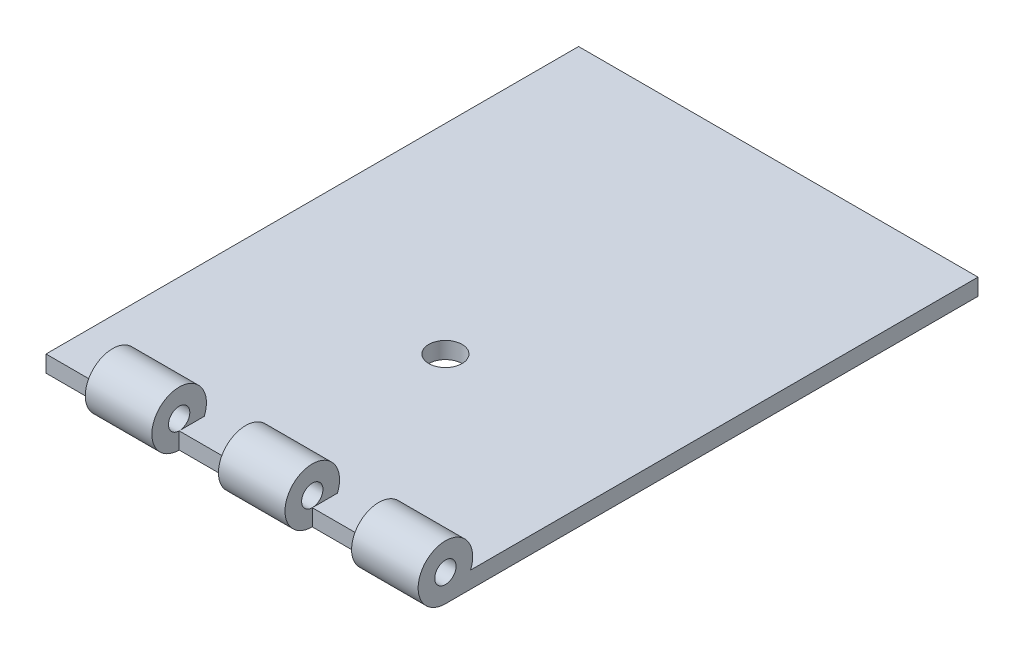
ISO-10303-21;
HEADER;
FILE_DESCRIPTION(('STEP AP214'),'2;1');
FILE_NAME('part.step','',(''),(''),'','','');
FILE_SCHEMA(('AUTOMOTIVE_DESIGN { 1 0 10303 214 1 1 1 1 }'));
ENDSEC;
DATA;
#1=APPLICATION_CONTEXT('core data for automotive mechanical design processes');
#2=APPLICATION_PROTOCOL_DEFINITION('international standard','automotive_design',2000,#1);
#3=PRODUCT_CONTEXT('',#1,'mechanical');
#4=PRODUCT('Part','Part','',(#3));
#5=PRODUCT_RELATED_PRODUCT_CATEGORY('part','',(#4));
#6=PRODUCT_DEFINITION_FORMATION('','',#4);
#7=PRODUCT_DEFINITION_CONTEXT('part definition',#1,'design');
#8=PRODUCT_DEFINITION('design','',#6,#7);
#9=PRODUCT_DEFINITION_SHAPE('','',#8);
#10=(LENGTH_UNIT() NAMED_UNIT(*) SI_UNIT(.MILLI.,.METRE.));
#11=(NAMED_UNIT(*) PLANE_ANGLE_UNIT() SI_UNIT($,.RADIAN.));
#12=(NAMED_UNIT(*) SI_UNIT($,.STERADIAN.) SOLID_ANGLE_UNIT());
#13=UNCERTAINTY_MEASURE_WITH_UNIT(LENGTH_MEASURE(1.E-05),#10,'distance_accuracy_value','');
#14=(GEOMETRIC_REPRESENTATION_CONTEXT(3) GLOBAL_UNCERTAINTY_ASSIGNED_CONTEXT((#13)) GLOBAL_UNIT_ASSIGNED_CONTEXT((#10,
#11,#12)) REPRESENTATION_CONTEXT('',''));
#15=CARTESIAN_POINT('',(0.,0.,0.));
#16=DIRECTION('',(0.,0.,1.));
#17=DIRECTION('',(1.,0.,0.));
#18=AXIS2_PLACEMENT_3D('',#15,#16,#17);
#19=CARTESIAN_POINT('',(-19.05,1.5875,38.1));
#20=DIRECTION('',(0.,0.,-1.));
#21=DIRECTION('',(-1.,0.,0.));
#22=AXIS2_PLACEMENT_3D('',#19,#20,#21);
#23=PLANE('',#22);
#24=DIRECTION('',(0.,-1.,0.));
#25=VECTOR('',#24,1.);
#26=CARTESIAN_POINT('',(-12.7,1.5875,38.1));
#27=LINE('',#26,#25);
#28=CARTESIAN_POINT('',(-12.7,1.5875,38.1));
#29=VERTEX_POINT('',#28);
#30=CARTESIAN_POINT('',(-12.7,0.,38.1));
#31=VERTEX_POINT('',#30);
#32=EDGE_CURVE('E161',#29,#31,#27,.T.);
#33=ORIENTED_EDGE('',*,*,#32,.F.);
#34=DIRECTION('',(1.,0.,0.));
#35=VECTOR('',#34,1.);
#36=CARTESIAN_POINT('',(-19.05,1.5875,38.1));
#37=LINE('',#36,#35);
#38=CARTESIAN_POINT('',(-19.05,1.5875,38.1));
#39=VERTEX_POINT('',#38);
#40=EDGE_CURVE('E217',#39,#29,#37,.T.);
#41=ORIENTED_EDGE('',*,*,#40,.F.);
#42=DIRECTION('',(0.,-1.,0.));
#43=VECTOR('',#42,1.);
#44=CARTESIAN_POINT('',(-19.05,1.5875,38.1));
#45=LINE('',#44,#43);
#46=CARTESIAN_POINT('',(-19.05,0.,38.1));
#47=VERTEX_POINT('',#46);
#48=EDGE_CURVE('E219',#39,#47,#45,.T.);
#49=ORIENTED_EDGE('',*,*,#48,.T.);
#50=DIRECTION('',(1.,0.,0.));
#51=VECTOR('',#50,1.);
#52=CARTESIAN_POINT('',(-19.05,0.,38.1));
#53=LINE('',#52,#51);
#54=EDGE_CURVE('E130',#47,#31,#53,.T.);
#55=ORIENTED_EDGE('',*,*,#54,.T.);
#56=EDGE_LOOP('',(#33,#41,#49,#55));
#57=FACE_BOUND('',#56,.T.);
#58=ADVANCED_FACE('F33',(#57),#23,.F.);
#59=CARTESIAN_POINT('',(0.,1.5875,0.));
#60=DIRECTION('',(0.,-1.,0.));
#61=DIRECTION('',(0.,0.,-1.));
#62=AXIS2_PLACEMENT_3D('',#59,#60,#61);
#63=PLANE('',#62);
#64=CARTESIAN_POINT('',(0.,1.5875,19.05));
#65=DIRECTION('',(0.,-1.,0.));
#66=DIRECTION('',(0.,0.,-1.));
#67=AXIS2_PLACEMENT_3D('',#64,#65,#66);
#68=CIRCLE('',#67,1.5875);
#69=CARTESIAN_POINT('',(0.,1.5875,20.6375));
#70=VERTEX_POINT('',#69);
#71=EDGE_CURVE('E451',#70,#70,#68,.T.);
#72=ORIENTED_EDGE('',*,*,#71,.T.);
#73=EDGE_LOOP('',(#72));
#74=FACE_BOUND('',#73,.T.);
#75=DIRECTION('',(0.,0.,1.));
#76=VECTOR('',#75,1.);
#77=CARTESIAN_POINT('',(-12.7,1.5875,0.));
#78=LINE('',#77,#76);
#79=CARTESIAN_POINT('',(-12.7,1.5875,35.7029275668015));
#80=VERTEX_POINT('',#79);
#81=EDGE_CURVE('E48',#80,#29,#78,.T.);
#82=ORIENTED_EDGE('',*,*,#81,.F.);
#83=DIRECTION('',(1.,0.,0.));
#84=VECTOR('',#83,1.);
#85=CARTESIAN_POINT('',(-12.7,1.5875,35.7029275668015));
#86=LINE('',#85,#84);
#87=CARTESIAN_POINT('',(-6.35,1.5875,35.7029275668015));
#88=VERTEX_POINT('',#87);
#89=EDGE_CURVE('E52',#80,#88,#86,.T.);
#90=ORIENTED_EDGE('',*,*,#89,.T.);
#91=DIRECTION('',(0.,0.,1.));
#92=VECTOR('',#91,1.);
#93=CARTESIAN_POINT('',(-6.35,1.5875,0.));
#94=LINE('',#93,#92);
#95=CARTESIAN_POINT('',(-6.35,1.5875,38.1));
#96=VERTEX_POINT('',#95);
#97=EDGE_CURVE('E140',#88,#96,#94,.T.);
#98=ORIENTED_EDGE('',*,*,#97,.T.);
#99=CARTESIAN_POINT('',(0.,1.5875,38.1));
#100=VERTEX_POINT('',#99);
#101=EDGE_CURVE('E135',#96,#100,#37,.T.);
#102=ORIENTED_EDGE('',*,*,#101,.T.);
#103=DIRECTION('',(0.,0.,1.));
#104=VECTOR('',#103,1.);
#105=CARTESIAN_POINT('',(0.,1.5875,0.));
#106=LINE('',#105,#104);
#107=CARTESIAN_POINT('',(0.,1.5875,35.7029275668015));
#108=VERTEX_POINT('',#107);
#109=EDGE_CURVE('E182',#108,#100,#106,.T.);
#110=ORIENTED_EDGE('',*,*,#109,.F.);
#111=DIRECTION('',(1.,0.,0.));
#112=VECTOR('',#111,1.);
#113=CARTESIAN_POINT('',(0.,1.5875,35.7029275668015));
#114=LINE('',#113,#112);
#115=CARTESIAN_POINT('',(6.35,1.5875,35.7029275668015));
#116=VERTEX_POINT('',#115);
#117=EDGE_CURVE('E187',#108,#116,#114,.T.);
#118=ORIENTED_EDGE('',*,*,#117,.T.);
#119=DIRECTION('',(0.,0.,1.));
#120=VECTOR('',#119,1.);
#121=CARTESIAN_POINT('',(6.35,1.5875,0.));
#122=LINE('',#121,#120);
#123=CARTESIAN_POINT('',(6.35,1.5875,38.1));
#124=VERTEX_POINT('',#123);
#125=EDGE_CURVE('E175',#116,#124,#122,.T.);
#126=ORIENTED_EDGE('',*,*,#125,.T.);
#127=CARTESIAN_POINT('',(12.7,1.5875,38.1));
#128=VERTEX_POINT('',#127);
#129=EDGE_CURVE('E216',#124,#128,#37,.T.);
#130=ORIENTED_EDGE('',*,*,#129,.T.);
#131=DIRECTION('',(0.,0.,1.));
#132=VECTOR('',#131,1.);
#133=CARTESIAN_POINT('',(12.7,1.5875,0.));
#134=LINE('',#133,#132);
#135=CARTESIAN_POINT('',(12.7,1.5875,35.7029275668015));
#136=VERTEX_POINT('',#135);
#137=EDGE_CURVE('E199',#136,#128,#134,.T.);
#138=ORIENTED_EDGE('',*,*,#137,.F.);
#139=DIRECTION('',(1.,0.,0.));
#140=VECTOR('',#139,1.);
#141=CARTESIAN_POINT('',(12.7,1.5875,35.7029275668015));
#142=LINE('',#141,#140);
#143=CARTESIAN_POINT('',(19.05,1.5875,35.7029275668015));
#144=VERTEX_POINT('',#143);
#145=EDGE_CURVE('E207',#136,#144,#142,.T.);
#146=ORIENTED_EDGE('',*,*,#145,.T.);
#147=DIRECTION('',(0.,0.,-1.));
#148=VECTOR('',#147,1.);
#149=CARTESIAN_POINT('',(19.05,1.5875,38.1));
#150=LINE('',#149,#148);
#151=CARTESIAN_POINT('',(19.05,1.5875,-12.7));
#152=VERTEX_POINT('',#151);
#153=EDGE_CURVE('E210',#144,#152,#150,.T.);
#154=ORIENTED_EDGE('',*,*,#153,.T.);
#155=DIRECTION('',(-1.,0.,0.));
#156=VECTOR('',#155,1.);
#157=CARTESIAN_POINT('',(-19.05,1.5875,-12.7));
#158=LINE('',#157,#156);
#159=CARTESIAN_POINT('',(-19.05,1.5875,-12.7));
#160=VERTEX_POINT('',#159);
#161=EDGE_CURVE('E212',#152,#160,#158,.T.);
#162=ORIENTED_EDGE('',*,*,#161,.T.);
#163=DIRECTION('',(0.,0.,1.));
#164=VECTOR('',#163,1.);
#165=CARTESIAN_POINT('',(-19.05,1.5875,38.1));
#166=LINE('',#165,#164);
#167=EDGE_CURVE('E214',#160,#39,#166,.T.);
#168=ORIENTED_EDGE('',*,*,#167,.T.);
#169=ORIENTED_EDGE('',*,*,#40,.T.);
#170=EDGE_LOOP('',(#82,#90,#98,#102,#110,#118,#126,#130,#138,#146,#154,#162,#168,#169));
#171=FACE_BOUND('',#170,.T.);
#172=ADVANCED_FACE('F257',(#74,#171),#63,.F.);
#173=ORIENTED_EDGE('',*,*,#101,.F.);
#174=DIRECTION('',(0.,-1.,0.));
#175=VECTOR('',#174,1.);
#176=CARTESIAN_POINT('',(-6.35,1.5875,38.1));
#177=LINE('',#176,#175);
#178=CARTESIAN_POINT('',(-6.35,0.,38.1));
#179=VERTEX_POINT('',#178);
#180=EDGE_CURVE('E133',#96,#179,#177,.T.);
#181=ORIENTED_EDGE('',*,*,#180,.T.);
#182=CARTESIAN_POINT('',(0.,0.,38.1));
#183=VERTEX_POINT('',#182);
#184=EDGE_CURVE('E117',#179,#183,#53,.T.);
#185=ORIENTED_EDGE('',*,*,#184,.T.);
#186=DIRECTION('',(0.,-1.,0.));
#187=VECTOR('',#186,1.);
#188=CARTESIAN_POINT('',(0.,1.5875,38.1));
#189=LINE('',#188,#187);
#190=EDGE_CURVE('E185',#100,#183,#189,.T.);
#191=ORIENTED_EDGE('',*,*,#190,.F.);
#192=EDGE_LOOP('',(#173,#181,#185,#191));
#193=FACE_BOUND('',#192,.T.);
#194=ADVANCED_FACE('F134',(#193),#23,.F.);
#195=ORIENTED_EDGE('',*,*,#129,.F.);
#196=DIRECTION('',(0.,-1.,0.));
#197=VECTOR('',#196,1.);
#198=CARTESIAN_POINT('',(6.35,1.5875,38.1));
#199=LINE('',#198,#197);
#200=CARTESIAN_POINT('',(6.35,0.,38.1));
#201=VERTEX_POINT('',#200);
#202=EDGE_CURVE('E179',#124,#201,#199,.T.);
#203=ORIENTED_EDGE('',*,*,#202,.T.);
#204=CARTESIAN_POINT('',(12.7,0.,38.1));
#205=VERTEX_POINT('',#204);
#206=EDGE_CURVE('E149',#201,#205,#53,.T.);
#207=ORIENTED_EDGE('',*,*,#206,.T.);
#208=DIRECTION('',(0.,-1.,0.));
#209=VECTOR('',#208,1.);
#210=CARTESIAN_POINT('',(12.7,1.5875,38.1));
#211=LINE('',#210,#209);
#212=EDGE_CURVE('E204',#128,#205,#211,.T.);
#213=ORIENTED_EDGE('',*,*,#212,.F.);
#214=EDGE_LOOP('',(#195,#203,#207,#213));
#215=FACE_BOUND('',#214,.T.);
#216=ADVANCED_FACE('F259',(#215),#23,.F.);
#217=CARTESIAN_POINT('',(19.05,1.5875,38.1));
#218=DIRECTION('',(-1.,0.,0.));
#219=DIRECTION('',(0.,0.,1.));
#220=AXIS2_PLACEMENT_3D('',#217,#218,#219);
#221=PLANE('',#220);
#222=ORIENTED_EDGE('',*,*,#153,.F.);
#223=CARTESIAN_POINT('',(19.05,2.6035,38.1));
#224=DIRECTION('',(1.,0.,0.));
#225=DIRECTION('',(0.,0.,-1.));
#226=AXIS2_PLACEMENT_3D('',#223,#224,#225);
#227=CIRCLE('',#226,2.6035);
#228=CARTESIAN_POINT('',(19.05,0.,38.1));
#229=VERTEX_POINT('',#228);
#230=EDGE_CURVE('E193',#144,#229,#227,.T.);
#231=ORIENTED_EDGE('',*,*,#230,.T.);
#232=DIRECTION('',(0.,0.,-1.));
#233=VECTOR('',#232,1.);
#234=CARTESIAN_POINT('',(19.05,0.,38.1));
#235=LINE('',#234,#233);
#236=CARTESIAN_POINT('',(19.05,0.,-12.7));
#237=VERTEX_POINT('',#236);
#238=EDGE_CURVE('E209',#229,#237,#235,.T.);
#239=ORIENTED_EDGE('',*,*,#238,.T.);
#240=DIRECTION('',(0.,-1.,0.));
#241=VECTOR('',#240,1.);
#242=CARTESIAN_POINT('',(19.05,1.5875,-12.7));
#243=LINE('',#242,#241);
#244=EDGE_CURVE('E11',#152,#237,#243,.T.);
#245=ORIENTED_EDGE('',*,*,#244,.F.);
#246=EDGE_LOOP('',(#222,#231,#239,#245));
#247=FACE_BOUND('',#246,.T.);
#248=CARTESIAN_POINT('',(19.05,2.6035,38.1));
#249=DIRECTION('',(1.,0.,0.));
#250=DIRECTION('',(0.,0.,-1.));
#251=AXIS2_PLACEMENT_3D('',#248,#249,#250);
#252=CIRCLE('',#251,1.016);
#253=CARTESIAN_POINT('',(19.05,2.6035,37.084));
#254=VERTEX_POINT('',#253);
#255=EDGE_CURVE('E189',#254,#254,#252,.T.);
#256=ORIENTED_EDGE('',*,*,#255,.F.);
#257=EDGE_LOOP('',(#256));
#258=FACE_BOUND('',#257,.T.);
#259=ADVANCED_FACE('F35',(#247,#258),#221,.F.);
#260=CARTESIAN_POINT('',(-19.05,1.5875,-12.7));
#261=DIRECTION('',(0.,0.,1.));
#262=DIRECTION('',(1.,0.,0.));
#263=AXIS2_PLACEMENT_3D('',#260,#261,#262);
#264=PLANE('',#263);
#265=DIRECTION('',(-1.,0.,0.));
#266=VECTOR('',#265,1.);
#267=CARTESIAN_POINT('',(-19.05,0.,-12.7));
#268=LINE('',#267,#266);
#269=CARTESIAN_POINT('',(-19.05,0.,-12.7));
#270=VERTEX_POINT('',#269);
#271=EDGE_CURVE('E222',#237,#270,#268,.T.);
#272=ORIENTED_EDGE('',*,*,#271,.T.);
#273=DIRECTION('',(0.,-1.,0.));
#274=VECTOR('',#273,1.);
#275=CARTESIAN_POINT('',(-19.05,1.5875,-12.7));
#276=LINE('',#275,#274);
#277=EDGE_CURVE('E41',#160,#270,#276,.T.);
#278=ORIENTED_EDGE('',*,*,#277,.F.);
#279=ORIENTED_EDGE('',*,*,#161,.F.);
#280=ORIENTED_EDGE('',*,*,#244,.T.);
#281=EDGE_LOOP('',(#272,#278,#279,#280));
#282=FACE_BOUND('',#281,.T.);
#283=ADVANCED_FACE('F273',(#282),#264,.F.);
#284=CARTESIAN_POINT('',(-19.05,1.5875,38.1));
#285=DIRECTION('',(1.,0.,0.));
#286=DIRECTION('',(0.,0.,-1.));
#287=AXIS2_PLACEMENT_3D('',#284,#285,#286);
#288=PLANE('',#287);
#289=DIRECTION('',(0.,0.,1.));
#290=VECTOR('',#289,1.);
#291=CARTESIAN_POINT('',(-19.05,0.,38.1));
#292=LINE('',#291,#290);
#293=EDGE_CURVE('E224',#270,#47,#292,.T.);
#294=ORIENTED_EDGE('',*,*,#293,.T.);
#295=ORIENTED_EDGE('',*,*,#48,.F.);
#296=ORIENTED_EDGE('',*,*,#167,.F.);
#297=ORIENTED_EDGE('',*,*,#277,.T.);
#298=EDGE_LOOP('',(#294,#295,#296,#297));
#299=FACE_BOUND('',#298,.T.);
#300=ADVANCED_FACE('F233',(#299),#288,.F.);
#301=CARTESIAN_POINT('',(0.,0.,0.));
#302=DIRECTION('',(0.,-1.,0.));
#303=DIRECTION('',(0.,0.,-1.));
#304=AXIS2_PLACEMENT_3D('',#301,#302,#303);
#305=PLANE('',#304);
#306=CARTESIAN_POINT('',(0.,0.,19.05));
#307=DIRECTION('',(0.,1.,0.));
#308=DIRECTION('',(0.,0.,1.));
#309=AXIS2_PLACEMENT_3D('',#306,#307,#308);
#310=CIRCLE('',#309,1.5875);
#311=CARTESIAN_POINT('',(0.,0.,20.6375));
#312=VERTEX_POINT('',#311);
#313=EDGE_CURVE('E450',#312,#312,#310,.T.);
#314=ORIENTED_EDGE('',*,*,#313,.T.);
#315=EDGE_LOOP('',(#314));
#316=FACE_BOUND('',#315,.T.);
#317=ORIENTED_EDGE('',*,*,#238,.F.);
#318=EDGE_CURVE('E225',#205,#229,#53,.T.);
#319=ORIENTED_EDGE('',*,*,#318,.F.);
#320=ORIENTED_EDGE('',*,*,#206,.F.);
#321=EDGE_CURVE('E125',#183,#201,#53,.T.);
#322=ORIENTED_EDGE('',*,*,#321,.F.);
#323=ORIENTED_EDGE('',*,*,#184,.F.);
#324=EDGE_CURVE('E122',#31,#179,#53,.T.);
#325=ORIENTED_EDGE('',*,*,#324,.F.);
#326=ORIENTED_EDGE('',*,*,#54,.F.);
#327=ORIENTED_EDGE('',*,*,#293,.F.);
#328=ORIENTED_EDGE('',*,*,#271,.F.);
#329=EDGE_LOOP('',(#317,#319,#320,#322,#323,#325,#326,#327,#328));
#330=FACE_BOUND('',#329,.T.);
#331=ADVANCED_FACE('F119',(#316,#330),#305,.T.);
#332=CARTESIAN_POINT('',(12.7,2.6035,38.1));
#333=DIRECTION('',(1.,0.,0.));
#334=DIRECTION('',(0.,0.,-1.));
#335=AXIS2_PLACEMENT_3D('',#332,#333,#334);
#336=CYLINDRICAL_SURFACE('',#335,2.6035);
#337=ORIENTED_EDGE('',*,*,#145,.F.);
#338=CARTESIAN_POINT('',(12.7,2.6035,38.1));
#339=DIRECTION('',(1.,0.,0.));
#340=DIRECTION('',(0.,0.,-1.));
#341=AXIS2_PLACEMENT_3D('',#338,#339,#340);
#342=CIRCLE('',#341,2.6035);
#343=EDGE_CURVE('E196',#136,#205,#342,.T.);
#344=ORIENTED_EDGE('',*,*,#343,.T.);
#345=ORIENTED_EDGE('',*,*,#318,.T.);
#346=ORIENTED_EDGE('',*,*,#230,.F.);
#347=EDGE_LOOP('',(#337,#344,#345,#346));
#348=FACE_BOUND('',#347,.T.);
#349=ADVANCED_FACE('F300',(#348),#336,.T.);
#350=CARTESIAN_POINT('',(12.7,2.6035,38.1));
#351=DIRECTION('',(1.,0.,0.));
#352=DIRECTION('',(0.,0.,-1.));
#353=AXIS2_PLACEMENT_3D('',#350,#351,#352);
#354=PLANE('',#353);
#355=CARTESIAN_POINT('',(12.7,2.6035,38.1));
#356=DIRECTION('',(1.,0.,0.));
#357=DIRECTION('',(0.,0.,-1.));
#358=AXIS2_PLACEMENT_3D('',#355,#356,#357);
#359=CIRCLE('',#358,1.016);
#360=EDGE_CURVE('E190',#128,#128,#359,.T.);
#361=ORIENTED_EDGE('',*,*,#360,.T.);
#362=ORIENTED_EDGE('',*,*,#212,.T.);
#363=ORIENTED_EDGE('',*,*,#343,.F.);
#364=ORIENTED_EDGE('',*,*,#137,.T.);
#365=EDGE_LOOP('',(#361,#362,#363,#364));
#366=FACE_BOUND('',#365,.T.);
#367=ADVANCED_FACE('F316',(#366),#354,.F.);
#368=CARTESIAN_POINT('',(12.7,2.6035,38.1));
#369=DIRECTION('',(1.,0.,0.));
#370=DIRECTION('',(0.,0.,-1.));
#371=AXIS2_PLACEMENT_3D('',#368,#369,#370);
#372=CYLINDRICAL_SURFACE('',#371,1.016);
#373=ORIENTED_EDGE('',*,*,#255,.T.);
#374=EDGE_LOOP('',(#373));
#375=FACE_BOUND('',#374,.T.);
#376=ORIENTED_EDGE('',*,*,#360,.F.);
#377=EDGE_LOOP('',(#376));
#378=FACE_BOUND('',#377,.T.);
#379=ADVANCED_FACE('F322',(#375,#378),#372,.F.);
#380=CARTESIAN_POINT('',(0.,2.6035,38.1));
#381=DIRECTION('',(1.,0.,0.));
#382=DIRECTION('',(0.,0.,-1.));
#383=AXIS2_PLACEMENT_3D('',#380,#381,#382);
#384=CYLINDRICAL_SURFACE('',#383,2.6035);
#385=ORIENTED_EDGE('',*,*,#117,.F.);
#386=CARTESIAN_POINT('',(0.,2.6035,38.1));
#387=DIRECTION('',(1.,0.,0.));
#388=DIRECTION('',(0.,0.,-1.));
#389=AXIS2_PLACEMENT_3D('',#386,#387,#388);
#390=CIRCLE('',#389,2.6035);
#391=EDGE_CURVE('E172',#108,#183,#390,.T.);
#392=ORIENTED_EDGE('',*,*,#391,.T.);
#393=ORIENTED_EDGE('',*,*,#321,.T.);
#394=CARTESIAN_POINT('',(6.35,2.6035,38.1));
#395=DIRECTION('',(1.,0.,0.));
#396=DIRECTION('',(0.,0.,-1.));
#397=AXIS2_PLACEMENT_3D('',#394,#395,#396);
#398=CIRCLE('',#397,2.6035);
#399=EDGE_CURVE('E169',#116,#201,#398,.T.);
#400=ORIENTED_EDGE('',*,*,#399,.F.);
#401=EDGE_LOOP('',(#385,#392,#393,#400));
#402=FACE_BOUND('',#401,.T.);
#403=ADVANCED_FACE('F294',(#402),#384,.T.);
#404=CARTESIAN_POINT('',(0.,2.6035,38.1));
#405=DIRECTION('',(1.,0.,0.));
#406=DIRECTION('',(0.,0.,-1.));
#407=AXIS2_PLACEMENT_3D('',#404,#405,#406);
#408=PLANE('',#407);
#409=CARTESIAN_POINT('',(0.,2.6035,38.1));
#410=DIRECTION('',(1.,0.,0.));
#411=DIRECTION('',(0.,0.,-1.));
#412=AXIS2_PLACEMENT_3D('',#409,#410,#411);
#413=CIRCLE('',#412,1.016);
#414=EDGE_CURVE('E166',#100,#100,#413,.T.);
#415=ORIENTED_EDGE('',*,*,#414,.T.);
#416=ORIENTED_EDGE('',*,*,#190,.T.);
#417=ORIENTED_EDGE('',*,*,#391,.F.);
#418=ORIENTED_EDGE('',*,*,#109,.T.);
#419=EDGE_LOOP('',(#415,#416,#417,#418));
#420=FACE_BOUND('',#419,.T.);
#421=ADVANCED_FACE('F290',(#420),#408,.F.);
#422=CARTESIAN_POINT('',(6.35,2.6035,38.1));
#423=DIRECTION('',(1.,0.,0.));
#424=DIRECTION('',(0.,0.,-1.));
#425=AXIS2_PLACEMENT_3D('',#422,#423,#424);
#426=PLANE('',#425);
#427=ORIENTED_EDGE('',*,*,#202,.F.);
#428=CARTESIAN_POINT('',(6.35,2.6035,38.1));
#429=DIRECTION('',(1.,0.,0.));
#430=DIRECTION('',(0.,0.,-1.));
#431=AXIS2_PLACEMENT_3D('',#428,#429,#430);
#432=CIRCLE('',#431,1.016);
#433=EDGE_CURVE('E165',#124,#124,#432,.T.);
#434=ORIENTED_EDGE('',*,*,#433,.F.);
#435=ORIENTED_EDGE('',*,*,#125,.F.);
#436=ORIENTED_EDGE('',*,*,#399,.T.);
#437=EDGE_LOOP('',(#427,#434,#435,#436));
#438=FACE_BOUND('',#437,.T.);
#439=ADVANCED_FACE('F280',(#438),#426,.T.);
#440=CARTESIAN_POINT('',(0.,2.6035,38.1));
#441=DIRECTION('',(1.,0.,0.));
#442=DIRECTION('',(0.,0.,-1.));
#443=AXIS2_PLACEMENT_3D('',#440,#441,#442);
#444=CYLINDRICAL_SURFACE('',#443,1.016);
#445=ORIENTED_EDGE('',*,*,#433,.T.);
#446=EDGE_LOOP('',(#445));
#447=FACE_BOUND('',#446,.T.);
#448=ORIENTED_EDGE('',*,*,#414,.F.);
#449=EDGE_LOOP('',(#448));
#450=FACE_BOUND('',#449,.T.);
#451=ADVANCED_FACE('F284',(#447,#450),#444,.F.);
#452=CARTESIAN_POINT('',(-12.7,2.6035,38.1));
#453=DIRECTION('',(1.,0.,0.));
#454=DIRECTION('',(0.,0.,-1.));
#455=AXIS2_PLACEMENT_3D('',#452,#453,#454);
#456=CYLINDRICAL_SURFACE('',#455,2.6035);
#457=ORIENTED_EDGE('',*,*,#89,.F.);
#458=CARTESIAN_POINT('',(-12.7,2.6035,38.1));
#459=DIRECTION('',(1.,0.,0.));
#460=DIRECTION('',(0.,0.,-1.));
#461=AXIS2_PLACEMENT_3D('',#458,#459,#460);
#462=CIRCLE('',#461,2.6035);
#463=EDGE_CURVE('E148',#80,#31,#462,.T.);
#464=ORIENTED_EDGE('',*,*,#463,.T.);
#465=ORIENTED_EDGE('',*,*,#324,.T.);
#466=CARTESIAN_POINT('',(-6.35,2.6035,38.1));
#467=DIRECTION('',(1.,0.,0.));
#468=DIRECTION('',(0.,0.,-1.));
#469=AXIS2_PLACEMENT_3D('',#466,#467,#468);
#470=CIRCLE('',#469,2.6035);
#471=EDGE_CURVE('E146',#88,#179,#470,.T.);
#472=ORIENTED_EDGE('',*,*,#471,.F.);
#473=EDGE_LOOP('',(#457,#464,#465,#472));
#474=FACE_BOUND('',#473,.T.);
#475=ADVANCED_FACE('F145',(#474),#456,.T.);
#476=CARTESIAN_POINT('',(-12.7,2.6035,38.1));
#477=DIRECTION('',(1.,0.,0.));
#478=DIRECTION('',(0.,0.,-1.));
#479=AXIS2_PLACEMENT_3D('',#476,#477,#478);
#480=PLANE('',#479);
#481=CARTESIAN_POINT('',(-12.7,2.6035,38.1));
#482=DIRECTION('',(1.,0.,0.));
#483=DIRECTION('',(0.,0.,-1.));
#484=AXIS2_PLACEMENT_3D('',#481,#482,#483);
#485=CIRCLE('',#484,1.016);
#486=EDGE_CURVE('E151',#29,#29,#485,.T.);
#487=ORIENTED_EDGE('',*,*,#486,.T.);
#488=ORIENTED_EDGE('',*,*,#32,.T.);
#489=ORIENTED_EDGE('',*,*,#463,.F.);
#490=ORIENTED_EDGE('',*,*,#81,.T.);
#491=EDGE_LOOP('',(#487,#488,#489,#490));
#492=FACE_BOUND('',#491,.T.);
#493=ADVANCED_FACE('F240',(#492),#480,.F.);
#494=CARTESIAN_POINT('',(-6.35,2.6035,38.1));
#495=DIRECTION('',(1.,0.,0.));
#496=DIRECTION('',(0.,0.,-1.));
#497=AXIS2_PLACEMENT_3D('',#494,#495,#496);
#498=PLANE('',#497);
#499=ORIENTED_EDGE('',*,*,#180,.F.);
#500=CARTESIAN_POINT('',(-6.35,2.6035,38.1));
#501=DIRECTION('',(1.,0.,0.));
#502=DIRECTION('',(0.,0.,-1.));
#503=AXIS2_PLACEMENT_3D('',#500,#501,#502);
#504=CIRCLE('',#503,1.016);
#505=EDGE_CURVE('E155',#96,#96,#504,.T.);
#506=ORIENTED_EDGE('',*,*,#505,.F.);
#507=ORIENTED_EDGE('',*,*,#97,.F.);
#508=ORIENTED_EDGE('',*,*,#471,.T.);
#509=EDGE_LOOP('',(#499,#506,#507,#508));
#510=FACE_BOUND('',#509,.T.);
#511=ADVANCED_FACE('F150',(#510),#498,.T.);
#512=CARTESIAN_POINT('',(-12.7,2.6035,38.1));
#513=DIRECTION('',(1.,0.,0.));
#514=DIRECTION('',(0.,0.,-1.));
#515=AXIS2_PLACEMENT_3D('',#512,#513,#514);
#516=CYLINDRICAL_SURFACE('',#515,1.016);
#517=ORIENTED_EDGE('',*,*,#505,.T.);
#518=EDGE_LOOP('',(#517));
#519=FACE_BOUND('',#518,.T.);
#520=ORIENTED_EDGE('',*,*,#486,.F.);
#521=EDGE_LOOP('',(#520));
#522=FACE_BOUND('',#521,.T.);
#523=ADVANCED_FACE('F243',(#519,#522),#516,.F.);
#524=CARTESIAN_POINT('',(0.,0.,19.05));
#525=DIRECTION('',(0.,1.,0.));
#526=DIRECTION('',(0.,0.,1.));
#527=AXIS2_PLACEMENT_3D('',#524,#525,#526);
#528=CYLINDRICAL_SURFACE('',#527,1.5875);
#529=CARTESIAN_POINT('',(0.,0.,20.6375));
#530=CARTESIAN_POINT('',(0.,0.0165364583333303,20.6375));
#531=CARTESIAN_POINT('',(0.,0.0330729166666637,20.6375));
#532=CARTESIAN_POINT('',(0.,0.0661458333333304,20.6375));
#533=CARTESIAN_POINT('',(0.,0.0826822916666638,20.6375));
#534=CARTESIAN_POINT('',(0.,0.115755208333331,20.6375));
#535=CARTESIAN_POINT('',(0.,0.132291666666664,20.6375));
#536=CARTESIAN_POINT('',(0.,0.165364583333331,20.6375));
#537=CARTESIAN_POINT('',(0.,0.181901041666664,20.6375));
#538=CARTESIAN_POINT('',(0.,0.214973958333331,20.6375));
#539=CARTESIAN_POINT('',(0.,0.231510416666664,20.6375));
#540=CARTESIAN_POINT('',(0.,0.264583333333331,20.6375));
#541=CARTESIAN_POINT('',(0.,0.281119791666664,20.6375));
#542=CARTESIAN_POINT('',(0.,0.314192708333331,20.6375));
#543=CARTESIAN_POINT('',(0.,0.330729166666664,20.6375));
#544=CARTESIAN_POINT('',(0.,0.363802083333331,20.6375));
#545=CARTESIAN_POINT('',(0.,0.380338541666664,20.6375));
#546=CARTESIAN_POINT('',(0.,0.413411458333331,20.6375));
#547=CARTESIAN_POINT('',(0.,0.429947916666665,20.6375));
#548=CARTESIAN_POINT('',(0.,0.463020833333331,20.6375));
#549=CARTESIAN_POINT('',(0.,0.479557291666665,20.6375));
#550=CARTESIAN_POINT('',(0.,0.512630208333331,20.6375));
#551=CARTESIAN_POINT('',(0.,0.529166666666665,20.6375));
#552=CARTESIAN_POINT('',(0.,0.562239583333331,20.6375));
#553=CARTESIAN_POINT('',(0.,0.578776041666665,20.6375));
#554=CARTESIAN_POINT('',(0.,0.611848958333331,20.6375));
#555=CARTESIAN_POINT('',(0.,0.628385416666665,20.6375));
#556=CARTESIAN_POINT('',(0.,0.661458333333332,20.6375));
#557=CARTESIAN_POINT('',(0.,0.677994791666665,20.6375));
#558=CARTESIAN_POINT('',(0.,0.711067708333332,20.6375));
#559=CARTESIAN_POINT('',(0.,0.727604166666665,20.6375));
#560=CARTESIAN_POINT('',(0.,0.760677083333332,20.6375));
#561=CARTESIAN_POINT('',(0.,0.777213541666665,20.6375));
#562=CARTESIAN_POINT('',(0.,0.810286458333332,20.6375));
#563=CARTESIAN_POINT('',(0.,0.826822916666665,20.6375));
#564=CARTESIAN_POINT('',(0.,0.859895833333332,20.6375));
#565=CARTESIAN_POINT('',(0.,0.876432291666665,20.6375));
#566=CARTESIAN_POINT('',(0.,0.909505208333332,20.6375));
#567=CARTESIAN_POINT('',(0.,0.926041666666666,20.6375));
#568=CARTESIAN_POINT('',(0.,0.959114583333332,20.6375));
#569=CARTESIAN_POINT('',(0.,0.975651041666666,20.6375));
#570=CARTESIAN_POINT('',(0.,1.00872395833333,20.6375));
#571=CARTESIAN_POINT('',(0.,1.02526041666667,20.6375));
#572=CARTESIAN_POINT('',(0.,1.05833333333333,20.6375));
#573=CARTESIAN_POINT('',(0.,1.07486979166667,20.6375));
#574=CARTESIAN_POINT('',(0.,1.10794270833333,20.6375));
#575=CARTESIAN_POINT('',(0.,1.12447916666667,20.6375));
#576=CARTESIAN_POINT('',(0.,1.15755208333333,20.6375));
#577=CARTESIAN_POINT('',(0.,1.17408854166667,20.6375));
#578=CARTESIAN_POINT('',(0.,1.20716145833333,20.6375));
#579=CARTESIAN_POINT('',(0.,1.22369791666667,20.6375));
#580=CARTESIAN_POINT('',(0.,1.25677083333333,20.6375));
#581=CARTESIAN_POINT('',(0.,1.27330729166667,20.6375));
#582=CARTESIAN_POINT('',(0.,1.30638020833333,20.6375));
#583=CARTESIAN_POINT('',(0.,1.32291666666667,20.6375));
#584=CARTESIAN_POINT('',(0.,1.35598958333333,20.6375));
#585=CARTESIAN_POINT('',(0.,1.37252604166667,20.6375));
#586=CARTESIAN_POINT('',(0.,1.40559895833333,20.6375));
#587=CARTESIAN_POINT('',(0.,1.42213541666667,20.6375));
#588=CARTESIAN_POINT('',(0.,1.45520833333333,20.6375));
#589=CARTESIAN_POINT('',(0.,1.47174479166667,20.6375));
#590=CARTESIAN_POINT('',(0.,1.50481770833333,20.6375));
#591=CARTESIAN_POINT('',(0.,1.52135416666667,20.6375));
#592=CARTESIAN_POINT('',(0.,1.55442708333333,20.6375));
#593=CARTESIAN_POINT('',(0.,1.57096354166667,20.6375));
#594=CARTESIAN_POINT('',(0.,1.5875,20.6375));
#595=B_SPLINE_CURVE_WITH_KNOTS('',3,(#529,#530,#531,#532,#533,#534,#535,#536,#537,#538,#539,
#540,#541,#542,#543,#544,#545,#546,#547,#548,#549,#550,#551,#552,#553,#554,#555,#556,#557,#558,
#559,#560,#561,#562,#563,#564,#565,#566,#567,#568,#569,#570,#571,#572,#573,#574,#575,#576,#577,
#578,#579,#580,#581,#582,#583,#584,#585,#586,#587,#588,#589,#590,#591,#592,#593,#594),
.UNSPECIFIED.,.F.,.F.,(4,2,2,2,2,2,2,2,2,2,2,2,2,2,2,2,2,2,2,2,2,2,2,2,2,2,2,2,2,2,2,2,4),(0.,
0.0496093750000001,0.0992187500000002,0.148828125,0.1984375,0.248046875,0.297656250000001,
0.347265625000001,0.396875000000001,0.446484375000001,0.496093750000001,0.545703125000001,
0.595312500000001,0.644921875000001,0.694531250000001,0.744140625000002,0.793750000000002,
0.843359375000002,0.892968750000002,0.942578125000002,0.992187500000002,1.041796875,1.09140625,
1.141015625,1.190625,1.240234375,1.28984375,1.339453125,1.3890625,1.438671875,1.48828125,
1.537890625,1.5875),.UNSPECIFIED.);
#596=EDGE_CURVE('BSEAM245',#312,#70,#595,.T.);
#597=ORIENTED_EDGE('',*,*,#313,.F.);
#598=ORIENTED_EDGE('',*,*,#71,.F.);
#599=ORIENTED_EDGE('',*,*,#596,.T.);
#600=ORIENTED_EDGE('',*,*,#596,.F.);
#601=EDGE_LOOP('',(#597,#599,#598,#600));
#602=FACE_BOUND('',#601,.T.);
#603=ADVANCED_FACE('F245',(#602),#528,.F.);
#604=CLOSED_SHELL('',(#58,#172,#194,#216,#259,#283,#300,#331,#349,#367,#379,#403,#421,#439,#451,
#475,#493,#511,#523,#603));
#605=MANIFOLD_SOLID_BREP('B2',#604);
#606=ADVANCED_BREP_SHAPE_REPRESENTATION('',(#18,#605),#14);
#607=SHAPE_DEFINITION_REPRESENTATION(#9,#606);
ENDSEC;
END-ISO-10303-21;
